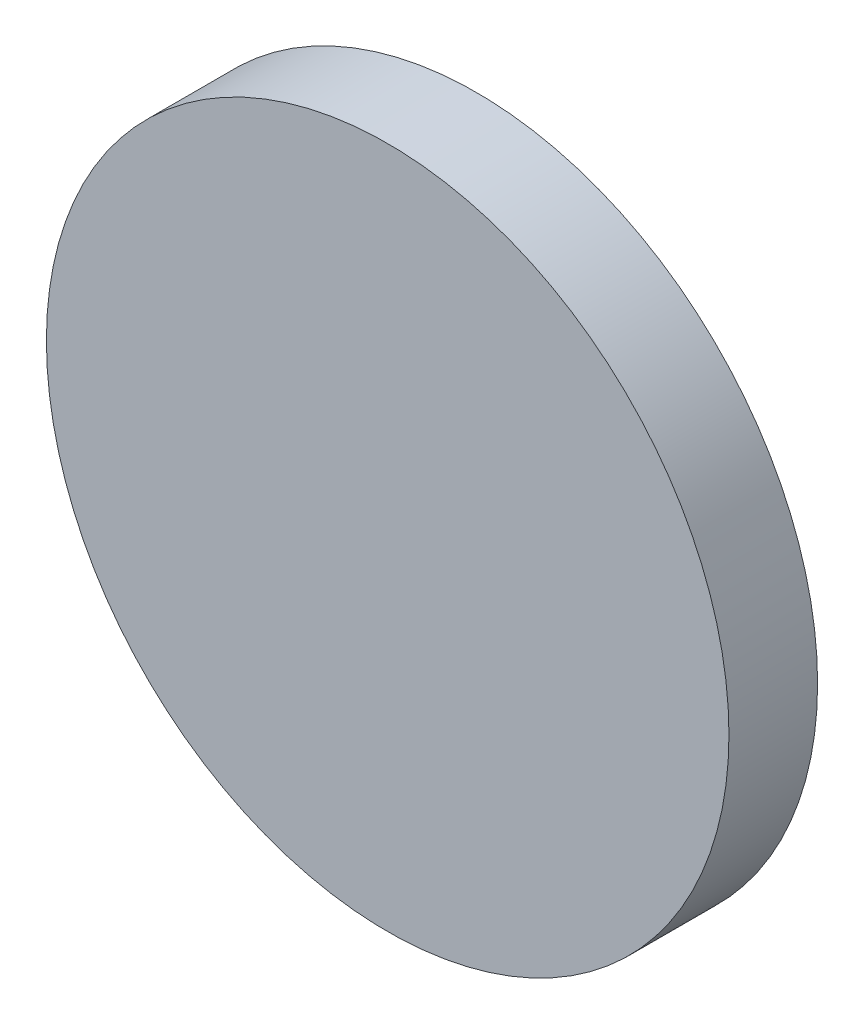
ISO-10303-21;
HEADER;
FILE_DESCRIPTION(('STEP AP214'),'2;1');
FILE_NAME('part.step','',(''),(''),'','','');
FILE_SCHEMA(('AUTOMOTIVE_DESIGN { 1 0 10303 214 1 1 1 1 }'));
ENDSEC;
DATA;
#1=APPLICATION_CONTEXT('core data for automotive mechanical design processes');
#2=APPLICATION_PROTOCOL_DEFINITION('international standard','automotive_design',2000,#1);
#3=PRODUCT_CONTEXT('',#1,'mechanical');
#4=PRODUCT('Part','Part','',(#3));
#5=PRODUCT_RELATED_PRODUCT_CATEGORY('part','',(#4));
#6=PRODUCT_DEFINITION_FORMATION('','',#4);
#7=PRODUCT_DEFINITION_CONTEXT('part definition',#1,'design');
#8=PRODUCT_DEFINITION('design','',#6,#7);
#9=PRODUCT_DEFINITION_SHAPE('','',#8);
#10=(LENGTH_UNIT() NAMED_UNIT(*) SI_UNIT(.MILLI.,.METRE.));
#11=(NAMED_UNIT(*) PLANE_ANGLE_UNIT() SI_UNIT($,.RADIAN.));
#12=(NAMED_UNIT(*) SI_UNIT($,.STERADIAN.) SOLID_ANGLE_UNIT());
#13=UNCERTAINTY_MEASURE_WITH_UNIT(LENGTH_MEASURE(1.E-05),#10,'distance_accuracy_value','');
#14=(GEOMETRIC_REPRESENTATION_CONTEXT(3) GLOBAL_UNCERTAINTY_ASSIGNED_CONTEXT((#13)) GLOBAL_UNIT_ASSIGNED_CONTEXT((#10,
#11,#12)) REPRESENTATION_CONTEXT('',''));
#15=CARTESIAN_POINT('',(0.,0.,0.));
#16=DIRECTION('',(0.,0.,1.));
#17=DIRECTION('',(1.,0.,0.));
#18=AXIS2_PLACEMENT_3D('',#15,#16,#17);
#19=CARTESIAN_POINT('',(0.,0.,1.));
#20=DIRECTION('',(0.,0.,-1.));
#21=DIRECTION('',(-1.,0.,0.));
#22=AXIS2_PLACEMENT_3D('',#19,#20,#21);
#23=CYLINDRICAL_SURFACE('',#22,3.85);
#24=CARTESIAN_POINT('',(0.,0.,1.));
#25=DIRECTION('',(0.,0.,1.));
#26=DIRECTION('',(1.,0.,0.));
#27=AXIS2_PLACEMENT_3D('',#24,#25,#26);
#28=CIRCLE('',#27,3.85);
#29=CARTESIAN_POINT('',(3.85,0.,1.));
#30=VERTEX_POINT('',#29);
#31=EDGE_CURVE('E10',#30,#30,#28,.T.);
#32=ORIENTED_EDGE('',*,*,#31,.F.);
#33=EDGE_LOOP('',(#32));
#34=FACE_BOUND('',#33,.T.);
#35=CARTESIAN_POINT('',(0.,0.,0.));
#36=DIRECTION('',(0.,0.,1.));
#37=DIRECTION('',(1.,0.,0.));
#38=AXIS2_PLACEMENT_3D('',#35,#36,#37);
#39=CIRCLE('',#38,3.85);
#40=CARTESIAN_POINT('',(3.85,0.,0.));
#41=VERTEX_POINT('',#40);
#42=EDGE_CURVE('E37',#41,#41,#39,.T.);
#43=ORIENTED_EDGE('',*,*,#42,.T.);
#44=EDGE_LOOP('',(#43));
#45=FACE_BOUND('',#44,.T.);
#46=ADVANCED_FACE('F34',(#34,#45),#23,.T.);
#47=CARTESIAN_POINT('',(0.,0.,1.));
#48=DIRECTION('',(0.,0.,1.));
#49=DIRECTION('',(1.,0.,0.));
#50=AXIS2_PLACEMENT_3D('',#47,#48,#49);
#51=PLANE('',#50);
#52=ORIENTED_EDGE('',*,*,#31,.T.);
#53=EDGE_LOOP('',(#52));
#54=FACE_BOUND('',#53,.T.);
#55=ADVANCED_FACE('F51',(#54),#51,.T.);
#56=CARTESIAN_POINT('',(0.,0.,0.));
#57=DIRECTION('',(0.,0.,1.));
#58=DIRECTION('',(1.,0.,0.));
#59=AXIS2_PLACEMENT_3D('',#56,#57,#58);
#60=PLANE('',#59);
#61=ORIENTED_EDGE('',*,*,#42,.F.);
#62=EDGE_LOOP('',(#61));
#63=FACE_BOUND('',#62,.T.);
#64=ADVANCED_FACE('F49',(#63),#60,.F.);
#65=CLOSED_SHELL('',(#46,#55,#64));
#66=MANIFOLD_SOLID_BREP('B2',#65);
#67=ADVANCED_BREP_SHAPE_REPRESENTATION('',(#18,#66),#14);
#68=SHAPE_DEFINITION_REPRESENTATION(#9,#67);
ENDSEC;
END-ISO-10303-21;
